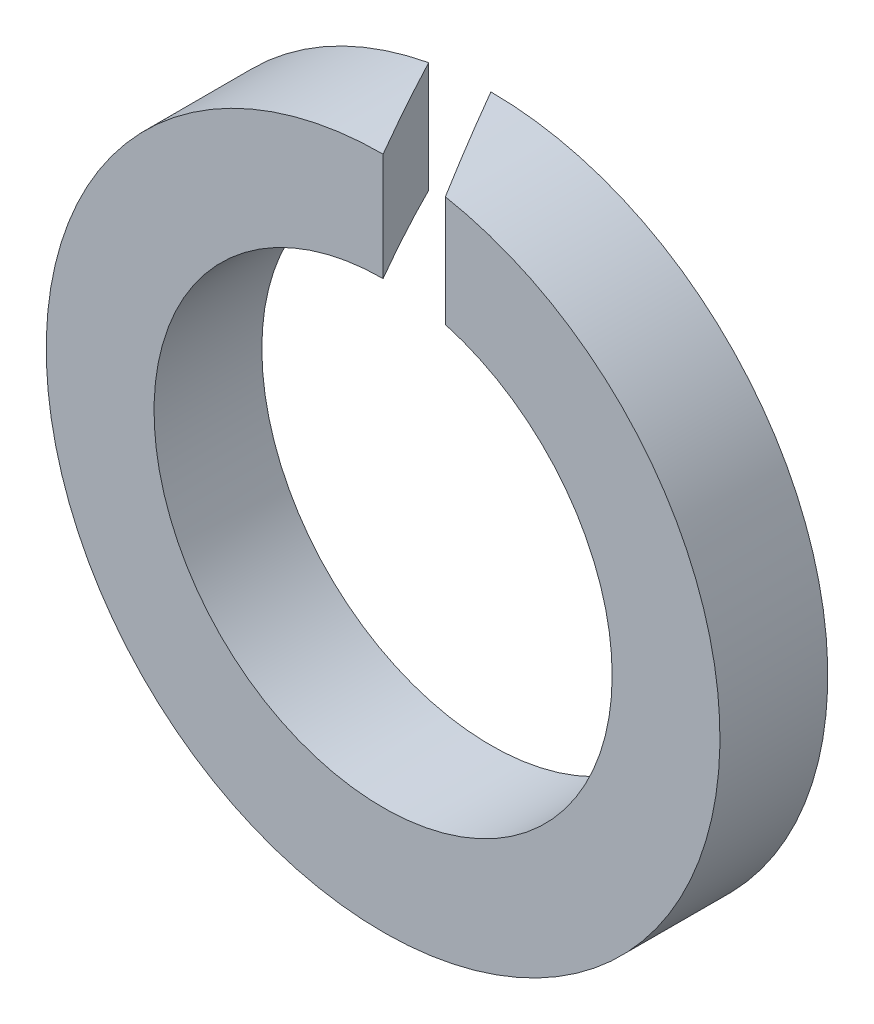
ISO-10303-21;
HEADER;
FILE_DESCRIPTION(('STEP AP214'),'2;1');
FILE_NAME('part.step','',(''),(''),'','','');
FILE_SCHEMA(('AUTOMOTIVE_DESIGN { 1 0 10303 214 1 1 1 1 }'));
ENDSEC;
DATA;
#1=APPLICATION_CONTEXT('core data for automotive mechanical design processes');
#2=APPLICATION_PROTOCOL_DEFINITION('international standard','automotive_design',2000,#1);
#3=PRODUCT_CONTEXT('',#1,'mechanical');
#4=PRODUCT('Part','Part','',(#3));
#5=PRODUCT_RELATED_PRODUCT_CATEGORY('part','',(#4));
#6=PRODUCT_DEFINITION_FORMATION('','',#4);
#7=PRODUCT_DEFINITION_CONTEXT('part definition',#1,'design');
#8=PRODUCT_DEFINITION('design','',#6,#7);
#9=PRODUCT_DEFINITION_SHAPE('','',#8);
#10=(LENGTH_UNIT() NAMED_UNIT(*) SI_UNIT(.MILLI.,.METRE.));
#11=(NAMED_UNIT(*) PLANE_ANGLE_UNIT() SI_UNIT($,.RADIAN.));
#12=(NAMED_UNIT(*) SI_UNIT($,.STERADIAN.) SOLID_ANGLE_UNIT());
#13=UNCERTAINTY_MEASURE_WITH_UNIT(LENGTH_MEASURE(1.E-05),#10,'distance_accuracy_value','');
#14=(GEOMETRIC_REPRESENTATION_CONTEXT(3) GLOBAL_UNCERTAINTY_ASSIGNED_CONTEXT((#13)) GLOBAL_UNIT_ASSIGNED_CONTEXT((#10,
#11,#12)) REPRESENTATION_CONTEXT('',''));
#15=CARTESIAN_POINT('',(0.,0.,0.));
#16=DIRECTION('',(0.,0.,1.));
#17=DIRECTION('',(1.,0.,0.));
#18=AXIS2_PLACEMENT_3D('',#15,#16,#17);
#19=CARTESIAN_POINT('',(0.,0.,-0.8));
#20=DIRECTION('',(0.,0.,1.));
#21=DIRECTION('',(1.,0.,0.));
#22=AXIS2_PLACEMENT_3D('',#19,#20,#21);
#23=CYLINDRICAL_SURFACE('',#22,2.5);
#24=CARTESIAN_POINT('',(0.,0.,0.));
#25=DIRECTION('',(0.,0.,1.));
#26=DIRECTION('',(1.,0.,0.));
#27=AXIS2_PLACEMENT_3D('',#24,#25,#26);
#28=CIRCLE('',#27,2.5);
#29=CARTESIAN_POINT('',(0.,2.5,0.));
#30=VERTEX_POINT('',#29);
#31=CARTESIAN_POINT('',(0.461880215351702,2.45696289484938,0.));
#32=VERTEX_POINT('',#31);
#33=EDGE_CURVE('E87',#30,#32,#28,.T.);
#34=ORIENTED_EDGE('',*,*,#33,.F.);
#35=CARTESIAN_POINT('',(0.,0.,0.));
#36=DIRECTION('',(0.866025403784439,0.,-0.5));
#37=DIRECTION('',(0.5,0.,0.866025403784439));
#38=AXIS2_PLACEMENT_3D('',#35,#36,#37);
#39=ELLIPSE('',#38,5.,2.5);
#40=CARTESIAN_POINT('',(-0.461880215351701,2.45696289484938,-0.8));
#41=VERTEX_POINT('',#40);
#42=EDGE_CURVE('E71',#30,#41,#39,.F.);
#43=ORIENTED_EDGE('',*,*,#42,.T.);
#44=CARTESIAN_POINT('',(0.,0.,-0.8));
#45=DIRECTION('',(0.,0.,1.));
#46=DIRECTION('',(1.,0.,0.));
#47=AXIS2_PLACEMENT_3D('',#44,#45,#46);
#48=CIRCLE('',#47,2.5);
#49=CARTESIAN_POINT('',(0.,2.5,-0.8));
#50=VERTEX_POINT('',#49);
#51=EDGE_CURVE('E92',#41,#50,#48,.T.);
#52=ORIENTED_EDGE('',*,*,#51,.T.);
#53=CARTESIAN_POINT('',(0.,0.,-0.8));
#54=DIRECTION('',(-0.866025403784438,0.,0.500000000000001));
#55=DIRECTION('',(0.500000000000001,0.,0.866025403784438));
#56=AXIS2_PLACEMENT_3D('',#53,#54,#55);
#57=ELLIPSE('',#56,4.99999999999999,2.5);
#58=EDGE_CURVE('E80',#50,#32,#57,.F.);
#59=ORIENTED_EDGE('',*,*,#58,.T.);
#60=EDGE_LOOP('',(#34,#43,#52,#59));
#61=FACE_BOUND('',#60,.T.);
#62=ADVANCED_FACE('F34',(#61),#23,.T.);
#63=CARTESIAN_POINT('',(0.,0.,-0.8));
#64=DIRECTION('',(0.,0.,1.));
#65=DIRECTION('',(1.,0.,0.));
#66=AXIS2_PLACEMENT_3D('',#63,#64,#65);
#67=PLANE('',#66);
#68=DIRECTION('',(0.,-1.,0.));
#69=VECTOR('',#68,1.);
#70=CARTESIAN_POINT('',(-0.461880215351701,2.5,-0.8));
#71=LINE('',#70,#69);
#72=CARTESIAN_POINT('',(-0.461880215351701,1.63605215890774,-0.8));
#73=VERTEX_POINT('',#72);
#74=EDGE_CURVE('E74',#41,#73,#71,.T.);
#75=ORIENTED_EDGE('',*,*,#74,.T.);
#76=CARTESIAN_POINT('',(0.,0.,-0.8));
#77=DIRECTION('',(0.,0.,1.));
#78=DIRECTION('',(1.,0.,0.));
#79=AXIS2_PLACEMENT_3D('',#76,#77,#78);
#80=CIRCLE('',#79,1.7);
#81=CARTESIAN_POINT('',(0.,1.7,-0.8));
#82=VERTEX_POINT('',#81);
#83=EDGE_CURVE('E93',#73,#82,#80,.T.);
#84=ORIENTED_EDGE('',*,*,#83,.T.);
#85=DIRECTION('',(0.,-1.,0.));
#86=VECTOR('',#85,1.);
#87=CARTESIAN_POINT('',(0.,2.5,-0.8));
#88=LINE('',#87,#86);
#89=EDGE_CURVE('E55',#50,#82,#88,.T.);
#90=ORIENTED_EDGE('',*,*,#89,.F.);
#91=ORIENTED_EDGE('',*,*,#51,.F.);
#92=EDGE_LOOP('',(#75,#84,#90,#91));
#93=FACE_BOUND('',#92,.T.);
#94=ADVANCED_FACE('F108',(#93),#67,.F.);
#95=CARTESIAN_POINT('',(0.,0.,0.));
#96=DIRECTION('',(0.,0.,1.));
#97=DIRECTION('',(1.,0.,0.));
#98=AXIS2_PLACEMENT_3D('',#95,#96,#97);
#99=PLANE('',#98);
#100=CARTESIAN_POINT('',(0.,0.,0.));
#101=DIRECTION('',(0.,0.,1.));
#102=DIRECTION('',(1.,0.,0.));
#103=AXIS2_PLACEMENT_3D('',#100,#101,#102);
#104=CIRCLE('',#103,1.7);
#105=CARTESIAN_POINT('',(0.,1.7,0.));
#106=VERTEX_POINT('',#105);
#107=CARTESIAN_POINT('',(0.461880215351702,1.63605215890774,0.));
#108=VERTEX_POINT('',#107);
#109=EDGE_CURVE('E79',#106,#108,#104,.T.);
#110=ORIENTED_EDGE('',*,*,#109,.F.);
#111=DIRECTION('',(0.,-1.,0.));
#112=VECTOR('',#111,1.);
#113=CARTESIAN_POINT('',(0.,2.5,0.));
#114=LINE('',#113,#112);
#115=EDGE_CURVE('E47',#30,#106,#114,.T.);
#116=ORIENTED_EDGE('',*,*,#115,.F.);
#117=ORIENTED_EDGE('',*,*,#33,.T.);
#118=DIRECTION('',(0.,-1.,0.));
#119=VECTOR('',#118,1.);
#120=CARTESIAN_POINT('',(0.461880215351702,2.5,0.));
#121=LINE('',#120,#119);
#122=EDGE_CURVE('E89',#32,#108,#121,.T.);
#123=ORIENTED_EDGE('',*,*,#122,.T.);
#124=EDGE_LOOP('',(#110,#116,#117,#123));
#125=FACE_BOUND('',#124,.T.);
#126=ADVANCED_FACE('F85',(#125),#99,.T.);
#127=CARTESIAN_POINT('',(0.,0.,-0.8));
#128=DIRECTION('',(0.,0.,1.));
#129=DIRECTION('',(1.,0.,0.));
#130=AXIS2_PLACEMENT_3D('',#127,#128,#129);
#131=CYLINDRICAL_SURFACE('',#130,1.7);
#132=CARTESIAN_POINT('',(0.,0.,0.));
#133=DIRECTION('',(0.866025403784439,0.,-0.5));
#134=DIRECTION('',(0.5,0.,0.866025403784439));
#135=AXIS2_PLACEMENT_3D('',#132,#133,#134);
#136=ELLIPSE('',#135,3.4,1.7);
#137=EDGE_CURVE('E11',#106,#73,#136,.F.);
#138=ORIENTED_EDGE('',*,*,#137,.F.);
#139=ORIENTED_EDGE('',*,*,#109,.T.);
#140=CARTESIAN_POINT('',(0.,0.,-0.8));
#141=DIRECTION('',(-0.866025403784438,0.,0.500000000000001));
#142=DIRECTION('',(0.500000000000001,0.,0.866025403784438));
#143=AXIS2_PLACEMENT_3D('',#140,#141,#142);
#144=ELLIPSE('',#143,3.4,1.7);
#145=EDGE_CURVE('E41',#82,#108,#144,.F.);
#146=ORIENTED_EDGE('',*,*,#145,.F.);
#147=ORIENTED_EDGE('',*,*,#83,.F.);
#148=EDGE_LOOP('',(#138,#139,#146,#147));
#149=FACE_BOUND('',#148,.T.);
#150=ADVANCED_FACE('F103',(#149),#131,.F.);
#151=CARTESIAN_POINT('',(0.,2.5,-0.8));
#152=DIRECTION('',(-0.866025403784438,0.,0.500000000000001));
#153=DIRECTION('',(0.500000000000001,0.,0.866025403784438));
#154=AXIS2_PLACEMENT_3D('',#151,#152,#153);
#155=PLANE('',#154);
#156=ORIENTED_EDGE('',*,*,#89,.T.);
#157=ORIENTED_EDGE('',*,*,#145,.T.);
#158=ORIENTED_EDGE('',*,*,#122,.F.);
#159=ORIENTED_EDGE('',*,*,#58,.F.);
#160=EDGE_LOOP('',(#156,#157,#158,#159));
#161=FACE_BOUND('',#160,.T.);
#162=ADVANCED_FACE('F99',(#161),#155,.T.);
#163=CARTESIAN_POINT('',(0.,2.5,0.));
#164=DIRECTION('',(0.866025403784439,0.,-0.5));
#165=DIRECTION('',(-0.5,0.,-0.866025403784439));
#166=AXIS2_PLACEMENT_3D('',#163,#164,#165);
#167=PLANE('',#166);
#168=ORIENTED_EDGE('',*,*,#115,.T.);
#169=ORIENTED_EDGE('',*,*,#137,.T.);
#170=ORIENTED_EDGE('',*,*,#74,.F.);
#171=ORIENTED_EDGE('',*,*,#42,.F.);
#172=EDGE_LOOP('',(#168,#169,#170,#171));
#173=FACE_BOUND('',#172,.T.);
#174=ADVANCED_FACE('F72',(#173),#167,.T.);
#175=CLOSED_SHELL('',(#62,#94,#126,#150,#162,#174));
#176=MANIFOLD_SOLID_BREP('B2',#175);
#177=ADVANCED_BREP_SHAPE_REPRESENTATION('',(#18,#176),#14);
#178=SHAPE_DEFINITION_REPRESENTATION(#9,#177);
ENDSEC;
END-ISO-10303-21;
